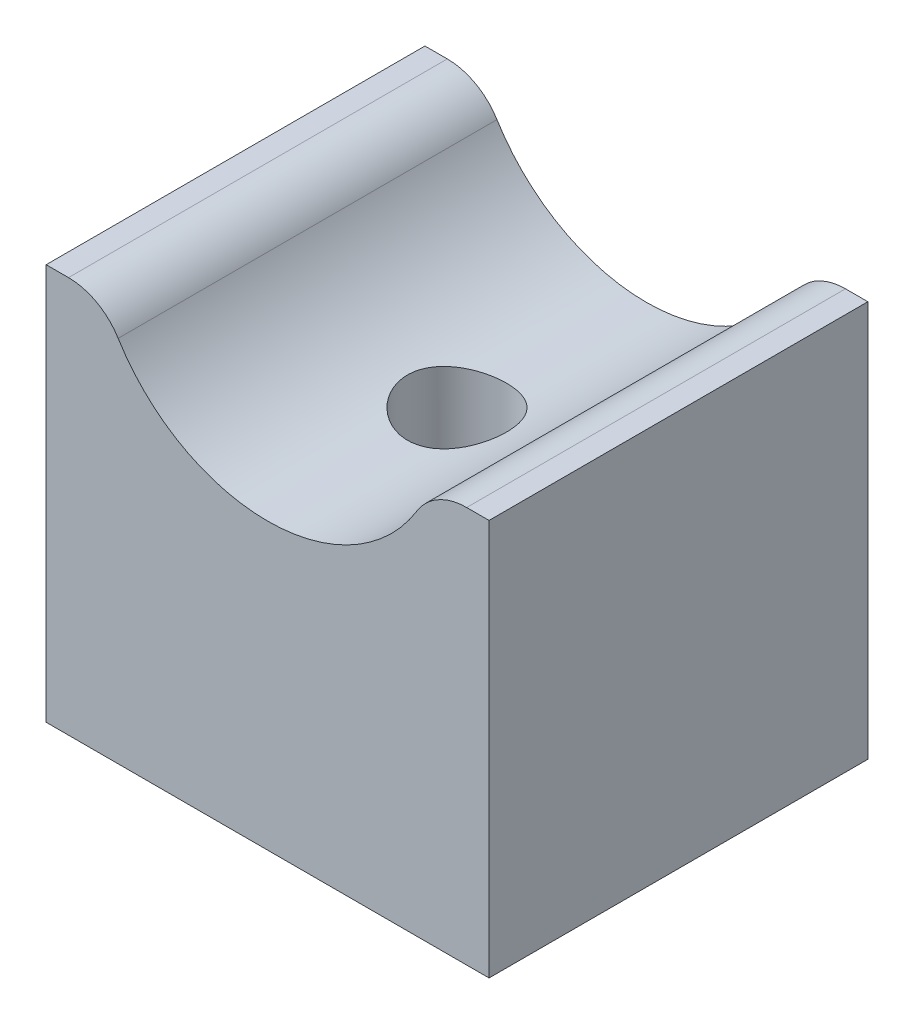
from build123d import *

# Parameters (mm, degrees)
SKIZZE1_W                                            = 38
SKIZZE1_H                                            = 34
AUFSATZ_LINEAR_AUSTRAGEN1_DEPTH                      = 32.5
SKIZZE2_R                                            = 15.05
SCHNITT_LINEAR_AUSTRAGEN1_DEPTH                      = 42.306779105
STIRNSENKUNG_F_R_M8_ZYLINDERSCHRAUBE_MIT_D           = 8.5
STIRNSENKUNG_F_R_M8_ZYLINDERSCHRAUBE_MIT_CBORE_D     = 15.013
STIRNSENKUNG_F_R_M8_ZYLINDERSCHRAUBE_MIT_CBORE_DEPTH = 2
VERRUNDUNG1_R                                        = 5


with BuildPart() as part:
    # Skizze1 → Aufsatz-Linear austragen1 (new body)
    with BuildSketch(Plane.XY):
        Rectangle(SKIZZE1_W, SKIZZE1_H)
    extrude(amount=AUFSATZ_LINEAR_AUSTRAGEN1_DEPTH)

    # Skizze2 → Schnitt-Linear austragen1 (cut, through all)
    with BuildSketch(Plane.XY):
        with Locations((0, 22.5)):
            Circle(SKIZZE2_R)
    extrude(amount=SCHNITT_LINEAR_AUSTRAGEN1_DEPTH, mode=Mode.SUBTRACT)

    # Stirnsenkung f_r M8 Zylinderschraube mit (through all)
    with Locations(Plane(origin=(0, -17, 16.25), x_dir=(0, 0, -1), z_dir=(0, -1, 0))):
        with Locations((0, 0)):
            CounterBoreHole(STIRNSENKUNG_F_R_M8_ZYLINDERSCHRAUBE_MIT_D / 2, STIRNSENKUNG_F_R_M8_ZYLINDERSCHRAUBE_MIT_CBORE_D / 2, STIRNSENKUNG_F_R_M8_ZYLINDERSCHRAUBE_MIT_CBORE_DEPTH)

    # Verrundung1
    verrundung1_edges = [part.edges().sort_by_distance(p)[0] for p in [
        (-14.009014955, 17, 16.25),
        (14.009014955, 17, 16.25),
    ]]
    fillet(verrundung1_edges, radius=VERRUNDUNG1_R)


solid = part.part
